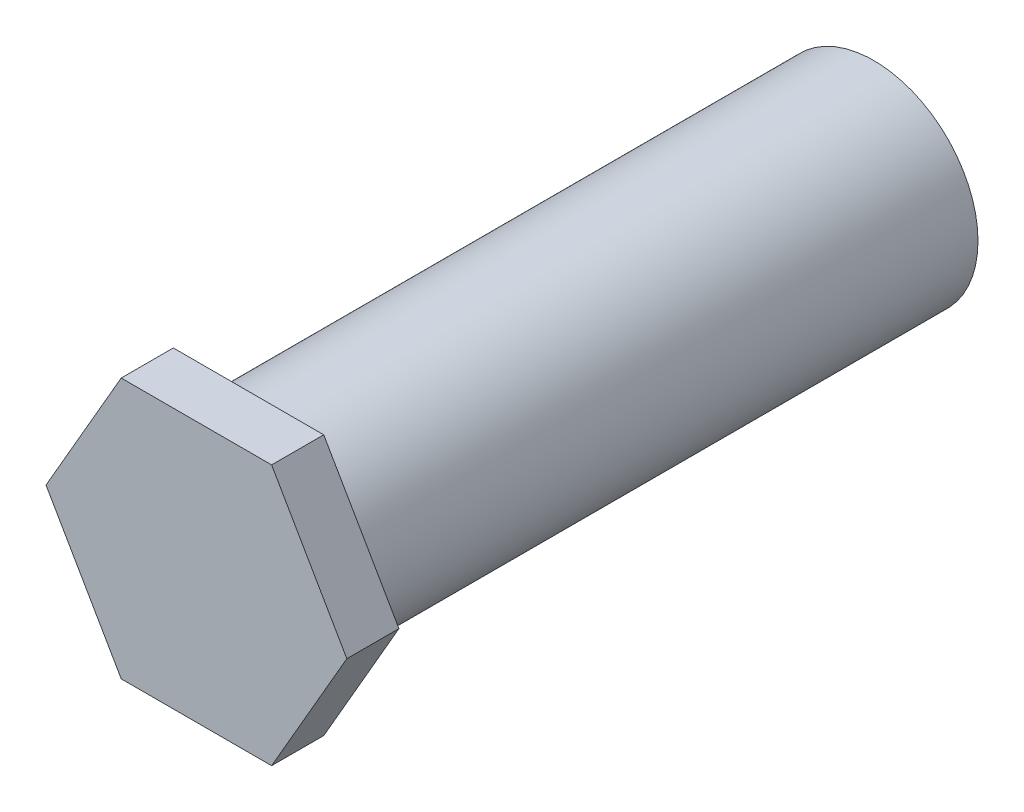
ISO-10303-21;
HEADER;
FILE_DESCRIPTION(('STEP AP214'),'2;1');
FILE_NAME('part.step','',(''),(''),'','','');
FILE_SCHEMA(('AUTOMOTIVE_DESIGN { 1 0 10303 214 1 1 1 1 }'));
ENDSEC;
DATA;
#1=APPLICATION_CONTEXT('core data for automotive mechanical design processes');
#2=APPLICATION_PROTOCOL_DEFINITION('international standard','automotive_design',2000,#1);
#3=PRODUCT_CONTEXT('',#1,'mechanical');
#4=PRODUCT('Part','Part','',(#3));
#5=PRODUCT_RELATED_PRODUCT_CATEGORY('part','',(#4));
#6=PRODUCT_DEFINITION_FORMATION('','',#4);
#7=PRODUCT_DEFINITION_CONTEXT('part definition',#1,'design');
#8=PRODUCT_DEFINITION('design','',#6,#7);
#9=PRODUCT_DEFINITION_SHAPE('','',#8);
#10=(LENGTH_UNIT() NAMED_UNIT(*) SI_UNIT(.MILLI.,.METRE.));
#11=(NAMED_UNIT(*) PLANE_ANGLE_UNIT() SI_UNIT($,.RADIAN.));
#12=(NAMED_UNIT(*) SI_UNIT($,.STERADIAN.) SOLID_ANGLE_UNIT());
#13=UNCERTAINTY_MEASURE_WITH_UNIT(LENGTH_MEASURE(1.E-05),#10,'distance_accuracy_value','');
#14=(GEOMETRIC_REPRESENTATION_CONTEXT(3) GLOBAL_UNCERTAINTY_ASSIGNED_CONTEXT((#13)) GLOBAL_UNIT_ASSIGNED_CONTEXT((#10,
#11,#12)) REPRESENTATION_CONTEXT('',''));
#15=CARTESIAN_POINT('',(0.,0.,0.));
#16=DIRECTION('',(0.,0.,1.));
#17=DIRECTION('',(1.,0.,0.));
#18=AXIS2_PLACEMENT_3D('',#15,#16,#17);
#19=CARTESIAN_POINT('',(0.,0.,60.));
#20=DIRECTION('',(0.,0.,-1.));
#21=DIRECTION('',(-1.,0.,0.));
#22=AXIS2_PLACEMENT_3D('',#19,#20,#21);
#23=CYLINDRICAL_SURFACE('',#22,10.);
#24=CARTESIAN_POINT('',(0.,0.,60.));
#25=DIRECTION('',(0.,0.,1.));
#26=DIRECTION('',(1.,0.,0.));
#27=AXIS2_PLACEMENT_3D('',#24,#25,#26);
#28=CIRCLE('',#27,10.);
#29=CARTESIAN_POINT('',(-10.,0.,60.));
#30=VERTEX_POINT('',#29);
#31=EDGE_CURVE('E11',#30,#30,#28,.T.);
#32=CARTESIAN_POINT('',(0.,0.,0.));
#33=DIRECTION('',(0.,0.,1.));
#34=DIRECTION('',(1.,0.,0.));
#35=AXIS2_PLACEMENT_3D('',#32,#33,#34);
#36=CIRCLE('',#35,10.);
#37=CARTESIAN_POINT('',(-10.,0.,0.));
#38=VERTEX_POINT('',#37);
#39=EDGE_CURVE('E357',#38,#38,#36,.T.);
#40=CARTESIAN_POINT('',(-10.,0.,60.));
#41=CARTESIAN_POINT('',(-10.,0.,59.375));
#42=CARTESIAN_POINT('',(-10.,0.,58.75));
#43=CARTESIAN_POINT('',(-10.,0.,57.5));
#44=CARTESIAN_POINT('',(-10.,0.,56.875));
#45=CARTESIAN_POINT('',(-10.,0.,55.625));
#46=CARTESIAN_POINT('',(-10.,0.,55.));
#47=CARTESIAN_POINT('',(-10.,0.,53.75));
#48=CARTESIAN_POINT('',(-10.,0.,53.125));
#49=CARTESIAN_POINT('',(-10.,0.,51.875));
#50=CARTESIAN_POINT('',(-10.,0.,51.25));
#51=CARTESIAN_POINT('',(-10.,0.,50.));
#52=CARTESIAN_POINT('',(-10.,0.,49.375));
#53=CARTESIAN_POINT('',(-10.,0.,48.125));
#54=CARTESIAN_POINT('',(-10.,0.,47.5));
#55=CARTESIAN_POINT('',(-10.,0.,46.25));
#56=CARTESIAN_POINT('',(-10.,0.,45.625));
#57=CARTESIAN_POINT('',(-10.,0.,44.375));
#58=CARTESIAN_POINT('',(-10.,0.,43.75));
#59=CARTESIAN_POINT('',(-10.,0.,42.5));
#60=CARTESIAN_POINT('',(-10.,0.,41.875));
#61=CARTESIAN_POINT('',(-10.,0.,40.625));
#62=CARTESIAN_POINT('',(-10.,0.,40.));
#63=CARTESIAN_POINT('',(-10.,0.,38.75));
#64=CARTESIAN_POINT('',(-10.,0.,38.125));
#65=CARTESIAN_POINT('',(-10.,0.,36.875));
#66=CARTESIAN_POINT('',(-10.,0.,36.25));
#67=CARTESIAN_POINT('',(-10.,0.,35.));
#68=CARTESIAN_POINT('',(-10.,0.,34.375));
#69=CARTESIAN_POINT('',(-10.,0.,33.125));
#70=CARTESIAN_POINT('',(-10.,0.,32.5));
#71=CARTESIAN_POINT('',(-10.,0.,31.25));
#72=CARTESIAN_POINT('',(-10.,0.,30.625));
#73=CARTESIAN_POINT('',(-10.,0.,29.375));
#74=CARTESIAN_POINT('',(-10.,0.,28.75));
#75=CARTESIAN_POINT('',(-10.,0.,27.5));
#76=CARTESIAN_POINT('',(-10.,0.,26.875));
#77=CARTESIAN_POINT('',(-10.,0.,25.625));
#78=CARTESIAN_POINT('',(-10.,0.,25.));
#79=CARTESIAN_POINT('',(-10.,0.,23.75));
#80=CARTESIAN_POINT('',(-10.,0.,23.125));
#81=CARTESIAN_POINT('',(-10.,0.,21.875));
#82=CARTESIAN_POINT('',(-10.,0.,21.25));
#83=CARTESIAN_POINT('',(-10.,0.,20.));
#84=CARTESIAN_POINT('',(-10.,0.,19.375));
#85=CARTESIAN_POINT('',(-10.,0.,18.125));
#86=CARTESIAN_POINT('',(-10.,0.,17.5));
#87=CARTESIAN_POINT('',(-10.,0.,16.25));
#88=CARTESIAN_POINT('',(-10.,0.,15.625));
#89=CARTESIAN_POINT('',(-10.,0.,14.375));
#90=CARTESIAN_POINT('',(-10.,0.,13.75));
#91=CARTESIAN_POINT('',(-10.,0.,12.5));
#92=CARTESIAN_POINT('',(-10.,0.,11.875));
#93=CARTESIAN_POINT('',(-10.,0.,10.625));
#94=CARTESIAN_POINT('',(-10.,0.,10.));
#95=CARTESIAN_POINT('',(-10.,0.,8.75));
#96=CARTESIAN_POINT('',(-10.,0.,8.125));
#97=CARTESIAN_POINT('',(-10.,0.,6.875));
#98=CARTESIAN_POINT('',(-10.,0.,6.25));
#99=CARTESIAN_POINT('',(-10.,0.,5.));
#100=CARTESIAN_POINT('',(-10.,0.,4.375));
#101=CARTESIAN_POINT('',(-10.,0.,3.125));
#102=CARTESIAN_POINT('',(-10.,0.,2.5));
#103=CARTESIAN_POINT('',(-10.,0.,1.25));
#104=CARTESIAN_POINT('',(-10.,0.,0.625000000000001));
#105=CARTESIAN_POINT('',(-10.,0.,0.));
#106=B_SPLINE_CURVE_WITH_KNOTS('',3,(#40,#41,#42,#43,#44,#45,#46,#47,#48,#49,#50,#51,#52,#53,
#54,#55,#56,#57,#58,#59,#60,#61,#62,#63,#64,#65,#66,#67,#68,#69,#70,#71,#72,#73,#74,#75,#76,#77,
#78,#79,#80,#81,#82,#83,#84,#85,#86,#87,#88,#89,#90,#91,#92,#93,#94,#95,#96,#97,#98,#99,#100,
#101,#102,#103,#104,#105),.UNSPECIFIED.,.F.,.F.,(4,2,2,2,2,2,2,2,2,2,2,2,2,2,2,2,2,2,2,2,2,2,2,
2,2,2,2,2,2,2,2,2,4),(0.,1.875,3.75,5.62500000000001,7.50000000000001,9.375,11.25,13.125,15.,
16.875,18.75,20.625,22.5,24.375,26.25,28.125,30.,31.875,33.75,35.625,37.5,39.375,41.25,43.125,
45.,46.875,48.75,50.625,52.5,54.375,56.25,58.125,60.),.UNSPECIFIED.);
#107=EDGE_CURVE('BSEAM350',#30,#38,#106,.T.);
#108=ORIENTED_EDGE('',*,*,#31,.F.);
#109=ORIENTED_EDGE('',*,*,#39,.T.);
#110=ORIENTED_EDGE('',*,*,#107,.T.);
#111=ORIENTED_EDGE('',*,*,#107,.F.);
#112=EDGE_LOOP('',(#108,#110,#109,#111));
#113=FACE_BOUND('',#112,.T.);
#114=ADVANCED_FACE('F350',(#113),#23,.T.);
#115=CARTESIAN_POINT('',(0.,0.,0.));
#116=DIRECTION('',(0.,0.,1.));
#117=DIRECTION('',(1.,0.,0.));
#118=AXIS2_PLACEMENT_3D('',#115,#116,#117);
#119=PLANE('',#118);
#120=ORIENTED_EDGE('',*,*,#39,.F.);
#121=EDGE_LOOP('',(#120));
#122=FACE_BOUND('',#121,.T.);
#123=ADVANCED_FACE('F458',(#122),#119,.F.);
#124=CARTESIAN_POINT('',(21.650635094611,12.5,60.));
#125=DIRECTION('',(0.,0.,1.));
#126=DIRECTION('',(1.,0.,0.));
#127=AXIS2_PLACEMENT_3D('',#124,#125,#126);
#128=PLANE('',#127);
#129=DIRECTION('',(0.5,0.866025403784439,0.));
#130=VECTOR('',#129,1.);
#131=CARTESIAN_POINT('',(7.21687836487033,-12.5,60.));
#132=LINE('',#131,#130);
#133=CARTESIAN_POINT('',(7.21687836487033,-12.5,60.));
#134=VERTEX_POINT('',#133);
#135=CARTESIAN_POINT('',(14.4337567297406,0.,60.));
#136=VERTEX_POINT('',#135);
#137=EDGE_CURVE('E408',#134,#136,#132,.T.);
#138=ORIENTED_EDGE('',*,*,#137,.F.);
#139=DIRECTION('',(1.,0.,0.));
#140=VECTOR('',#139,1.);
#141=CARTESIAN_POINT('',(-7.21687836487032,-12.5,60.));
#142=LINE('',#141,#140);
#143=CARTESIAN_POINT('',(-7.21687836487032,-12.5,60.));
#144=VERTEX_POINT('',#143);
#145=EDGE_CURVE('E433',#144,#134,#142,.T.);
#146=ORIENTED_EDGE('',*,*,#145,.F.);
#147=DIRECTION('',(0.5,-0.866025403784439,0.));
#148=VECTOR('',#147,1.);
#149=CARTESIAN_POINT('',(-14.4337567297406,0.,60.));
#150=LINE('',#149,#148);
#151=CARTESIAN_POINT('',(-14.4337567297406,0.,60.));
#152=VERTEX_POINT('',#151);
#153=EDGE_CURVE('E431',#152,#144,#150,.T.);
#154=ORIENTED_EDGE('',*,*,#153,.F.);
#155=DIRECTION('',(-0.5,-0.866025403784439,0.));
#156=VECTOR('',#155,1.);
#157=CARTESIAN_POINT('',(-7.21687836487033,12.5,60.));
#158=LINE('',#157,#156);
#159=CARTESIAN_POINT('',(-7.21687836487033,12.5,60.));
#160=VERTEX_POINT('',#159);
#161=EDGE_CURVE('E429',#160,#152,#158,.T.);
#162=ORIENTED_EDGE('',*,*,#161,.F.);
#163=DIRECTION('',(-1.,0.,0.));
#164=VECTOR('',#163,1.);
#165=CARTESIAN_POINT('',(7.21687836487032,12.5,60.));
#166=LINE('',#165,#164);
#167=CARTESIAN_POINT('',(7.21687836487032,12.5,60.));
#168=VERTEX_POINT('',#167);
#169=EDGE_CURVE('E410',#168,#160,#166,.T.);
#170=ORIENTED_EDGE('',*,*,#169,.F.);
#171=DIRECTION('',(-0.5,0.866025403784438,0.));
#172=VECTOR('',#171,1.);
#173=CARTESIAN_POINT('',(14.4337567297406,0.,60.));
#174=LINE('',#173,#172);
#175=EDGE_CURVE('E402',#136,#168,#174,.T.);
#176=ORIENTED_EDGE('',*,*,#175,.F.);
#177=EDGE_LOOP('',(#138,#146,#154,#162,#170,#176));
#178=FACE_BOUND('',#177,.T.);
#179=ORIENTED_EDGE('',*,*,#31,.T.);
#180=EDGE_LOOP('',(#179));
#181=FACE_BOUND('',#180,.T.);
#182=ADVANCED_FACE('F404',(#178,#181),#128,.F.);
#183=CARTESIAN_POINT('',(7.21687836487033,-12.5,65.));
#184=DIRECTION('',(-0.866025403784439,0.5,0.));
#185=DIRECTION('',(-0.5,-0.866025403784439,0.));
#186=AXIS2_PLACEMENT_3D('',#183,#184,#185);
#187=PLANE('',#186);
#188=ORIENTED_EDGE('',*,*,#137,.T.);
#189=DIRECTION('',(0.,0.,-1.));
#190=VECTOR('',#189,1.);
#191=CARTESIAN_POINT('',(14.4337567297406,0.,65.));
#192=LINE('',#191,#190);
#193=CARTESIAN_POINT('',(14.4337567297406,0.,65.));
#194=VERTEX_POINT('',#193);
#195=EDGE_CURVE('E416',#194,#136,#192,.T.);
#196=ORIENTED_EDGE('',*,*,#195,.F.);
#197=DIRECTION('',(0.5,0.866025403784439,0.));
#198=VECTOR('',#197,1.);
#199=CARTESIAN_POINT('',(7.21687836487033,-12.5,65.));
#200=LINE('',#199,#198);
#201=CARTESIAN_POINT('',(7.21687836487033,-12.5,65.));
#202=VERTEX_POINT('',#201);
#203=EDGE_CURVE('E435',#202,#194,#200,.T.);
#204=ORIENTED_EDGE('',*,*,#203,.F.);
#205=DIRECTION('',(0.,0.,-1.));
#206=VECTOR('',#205,1.);
#207=CARTESIAN_POINT('',(7.21687836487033,-12.5,65.));
#208=LINE('',#207,#206);
#209=EDGE_CURVE('E425',#202,#134,#208,.T.);
#210=ORIENTED_EDGE('',*,*,#209,.T.);
#211=EDGE_LOOP('',(#188,#196,#204,#210));
#212=FACE_BOUND('',#211,.T.);
#213=ADVANCED_FACE('F424',(#212),#187,.F.);
#214=CARTESIAN_POINT('',(14.4337567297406,0.,65.));
#215=DIRECTION('',(-0.866025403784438,-0.5,0.));
#216=DIRECTION('',(0.5,-0.866025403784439,0.));
#217=AXIS2_PLACEMENT_3D('',#214,#215,#216);
#218=PLANE('',#217);
#219=ORIENTED_EDGE('',*,*,#175,.T.);
#220=DIRECTION('',(0.,0.,-1.));
#221=VECTOR('',#220,1.);
#222=CARTESIAN_POINT('',(7.21687836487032,12.5,65.));
#223=LINE('',#222,#221);
#224=CARTESIAN_POINT('',(7.21687836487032,12.5,65.));
#225=VERTEX_POINT('',#224);
#226=EDGE_CURVE('E421',#225,#168,#223,.T.);
#227=ORIENTED_EDGE('',*,*,#226,.F.);
#228=DIRECTION('',(-0.5,0.866025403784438,0.));
#229=VECTOR('',#228,1.);
#230=CARTESIAN_POINT('',(14.4337567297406,0.,65.));
#231=LINE('',#230,#229);
#232=EDGE_CURVE('E418',#194,#225,#231,.T.);
#233=ORIENTED_EDGE('',*,*,#232,.F.);
#234=ORIENTED_EDGE('',*,*,#195,.T.);
#235=EDGE_LOOP('',(#219,#227,#233,#234));
#236=FACE_BOUND('',#235,.T.);
#237=ADVANCED_FACE('F417',(#236),#218,.F.);
#238=CARTESIAN_POINT('',(7.21687836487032,12.5,65.));
#239=DIRECTION('',(0.,-1.,0.));
#240=DIRECTION('',(0.,0.,-1.));
#241=AXIS2_PLACEMENT_3D('',#238,#239,#240);
#242=PLANE('',#241);
#243=ORIENTED_EDGE('',*,*,#169,.T.);
#244=DIRECTION('',(0.,0.,-1.));
#245=VECTOR('',#244,1.);
#246=CARTESIAN_POINT('',(-7.21687836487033,12.5,65.));
#247=LINE('',#246,#245);
#248=CARTESIAN_POINT('',(-7.21687836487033,12.5,65.));
#249=VERTEX_POINT('',#248);
#250=EDGE_CURVE('E451',#249,#160,#247,.T.);
#251=ORIENTED_EDGE('',*,*,#250,.F.);
#252=DIRECTION('',(-1.,0.,0.));
#253=VECTOR('',#252,1.);
#254=CARTESIAN_POINT('',(7.21687836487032,12.5,65.));
#255=LINE('',#254,#253);
#256=EDGE_CURVE('E438',#225,#249,#255,.T.);
#257=ORIENTED_EDGE('',*,*,#256,.F.);
#258=ORIENTED_EDGE('',*,*,#226,.T.);
#259=EDGE_LOOP('',(#243,#251,#257,#258));
#260=FACE_BOUND('',#259,.T.);
#261=ADVANCED_FACE('F471',(#260),#242,.F.);
#262=CARTESIAN_POINT('',(-7.21687836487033,12.5,65.));
#263=DIRECTION('',(0.866025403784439,-0.5,0.));
#264=DIRECTION('',(0.5,0.866025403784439,0.));
#265=AXIS2_PLACEMENT_3D('',#262,#263,#264);
#266=PLANE('',#265);
#267=ORIENTED_EDGE('',*,*,#161,.T.);
#268=DIRECTION('',(0.,0.,-1.));
#269=VECTOR('',#268,1.);
#270=CARTESIAN_POINT('',(-14.4337567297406,0.,65.));
#271=LINE('',#270,#269);
#272=CARTESIAN_POINT('',(-14.4337567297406,0.,65.));
#273=VERTEX_POINT('',#272);
#274=EDGE_CURVE('E448',#273,#152,#271,.T.);
#275=ORIENTED_EDGE('',*,*,#274,.F.);
#276=DIRECTION('',(-0.5,-0.866025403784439,0.));
#277=VECTOR('',#276,1.);
#278=CARTESIAN_POINT('',(-7.21687836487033,12.5,65.));
#279=LINE('',#278,#277);
#280=EDGE_CURVE('E440',#249,#273,#279,.T.);
#281=ORIENTED_EDGE('',*,*,#280,.F.);
#282=ORIENTED_EDGE('',*,*,#250,.T.);
#283=EDGE_LOOP('',(#267,#275,#281,#282));
#284=FACE_BOUND('',#283,.T.);
#285=ADVANCED_FACE('F474',(#284),#266,.F.);
#286=CARTESIAN_POINT('',(-14.4337567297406,0.,65.));
#287=DIRECTION('',(0.866025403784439,0.5,0.));
#288=DIRECTION('',(-0.5,0.866025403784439,0.));
#289=AXIS2_PLACEMENT_3D('',#286,#287,#288);
#290=PLANE('',#289);
#291=ORIENTED_EDGE('',*,*,#153,.T.);
#292=DIRECTION('',(0.,0.,-1.));
#293=VECTOR('',#292,1.);
#294=CARTESIAN_POINT('',(-7.21687836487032,-12.5,65.));
#295=LINE('',#294,#293);
#296=CARTESIAN_POINT('',(-7.21687836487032,-12.5,65.));
#297=VERTEX_POINT('',#296);
#298=EDGE_CURVE('E445',#297,#144,#295,.T.);
#299=ORIENTED_EDGE('',*,*,#298,.F.);
#300=DIRECTION('',(0.5,-0.866025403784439,0.));
#301=VECTOR('',#300,1.);
#302=CARTESIAN_POINT('',(-14.4337567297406,0.,65.));
#303=LINE('',#302,#301);
#304=EDGE_CURVE('E369',#273,#297,#303,.T.);
#305=ORIENTED_EDGE('',*,*,#304,.F.);
#306=ORIENTED_EDGE('',*,*,#274,.T.);
#307=EDGE_LOOP('',(#291,#299,#305,#306));
#308=FACE_BOUND('',#307,.T.);
#309=ADVANCED_FACE('F478',(#308),#290,.F.);
#310=CARTESIAN_POINT('',(-7.21687836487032,-12.5,65.));
#311=DIRECTION('',(0.,1.,0.));
#312=DIRECTION('',(-1.,0.,0.));
#313=AXIS2_PLACEMENT_3D('',#310,#311,#312);
#314=PLANE('',#313);
#315=ORIENTED_EDGE('',*,*,#145,.T.);
#316=ORIENTED_EDGE('',*,*,#209,.F.);
#317=DIRECTION('',(1.,0.,0.));
#318=VECTOR('',#317,1.);
#319=CARTESIAN_POINT('',(-7.21687836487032,-12.5,65.));
#320=LINE('',#319,#318);
#321=EDGE_CURVE('E364',#297,#202,#320,.T.);
#322=ORIENTED_EDGE('',*,*,#321,.F.);
#323=ORIENTED_EDGE('',*,*,#298,.T.);
#324=EDGE_LOOP('',(#315,#316,#322,#323));
#325=FACE_BOUND('',#324,.T.);
#326=ADVANCED_FACE('F482',(#325),#314,.F.);
#327=CARTESIAN_POINT('',(21.650635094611,12.5,65.));
#328=DIRECTION('',(0.,0.,1.));
#329=DIRECTION('',(1.,0.,0.));
#330=AXIS2_PLACEMENT_3D('',#327,#328,#329);
#331=PLANE('',#330);
#332=ORIENTED_EDGE('',*,*,#203,.T.);
#333=ORIENTED_EDGE('',*,*,#232,.T.);
#334=ORIENTED_EDGE('',*,*,#256,.T.);
#335=ORIENTED_EDGE('',*,*,#280,.T.);
#336=ORIENTED_EDGE('',*,*,#304,.T.);
#337=ORIENTED_EDGE('',*,*,#321,.T.);
#338=EDGE_LOOP('',(#332,#333,#334,#335,#336,#337));
#339=FACE_BOUND('',#338,.T.);
#340=ADVANCED_FACE('F486',(#339),#331,.T.);
#341=CLOSED_SHELL('',(#114,#123,#182,#213,#237,#261,#285,#309,#326,#340));
#342=MANIFOLD_SOLID_BREP('B2',#341);
#343=ADVANCED_BREP_SHAPE_REPRESENTATION('',(#18,#342),#14);
#344=SHAPE_DEFINITION_REPRESENTATION(#9,#343);
ENDSEC;
END-ISO-10303-21;
